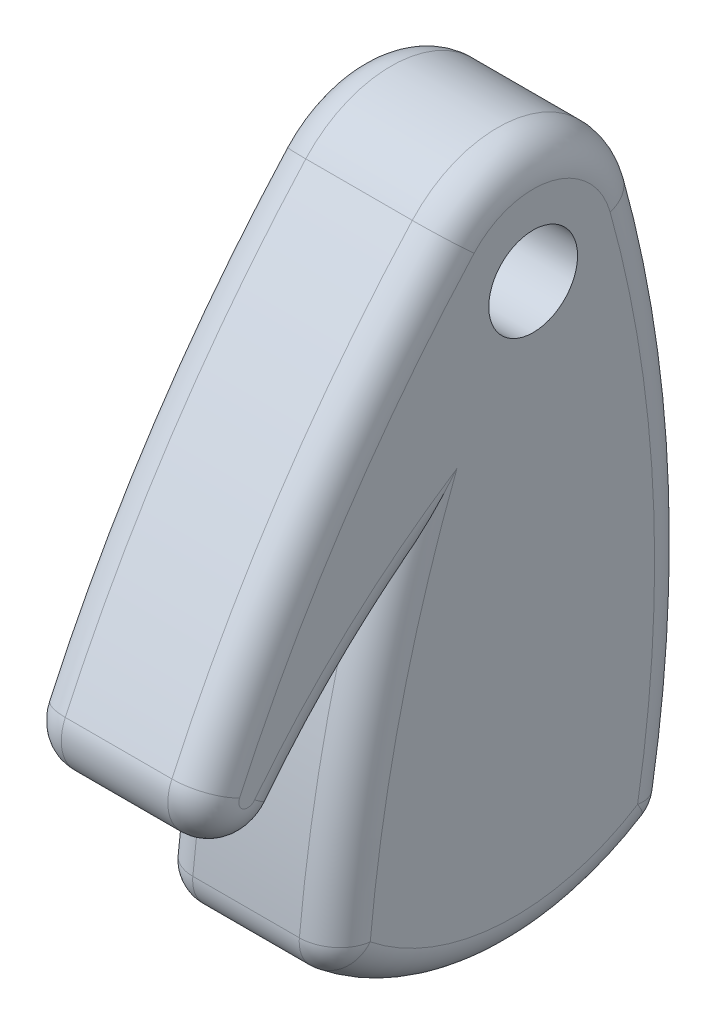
ISO-10303-21;
HEADER;
FILE_DESCRIPTION(('STEP AP214'),'2;1');
FILE_NAME('part.step','',(''),(''),'','','');
FILE_SCHEMA(('AUTOMOTIVE_DESIGN { 1 0 10303 214 1 1 1 1 }'));
ENDSEC;
DATA;
#1=APPLICATION_CONTEXT('core data for automotive mechanical design processes');
#2=APPLICATION_PROTOCOL_DEFINITION('international standard','automotive_design',2000,#1);
#3=PRODUCT_CONTEXT('',#1,'mechanical');
#4=PRODUCT('Part','Part','',(#3));
#5=PRODUCT_RELATED_PRODUCT_CATEGORY('part','',(#4));
#6=PRODUCT_DEFINITION_FORMATION('','',#4);
#7=PRODUCT_DEFINITION_CONTEXT('part definition',#1,'design');
#8=PRODUCT_DEFINITION('design','',#6,#7);
#9=PRODUCT_DEFINITION_SHAPE('','',#8);
#10=(LENGTH_UNIT() NAMED_UNIT(*) SI_UNIT(.MILLI.,.METRE.));
#11=(NAMED_UNIT(*) PLANE_ANGLE_UNIT() SI_UNIT($,.RADIAN.));
#12=(NAMED_UNIT(*) SI_UNIT($,.STERADIAN.) SOLID_ANGLE_UNIT());
#13=UNCERTAINTY_MEASURE_WITH_UNIT(LENGTH_MEASURE(1.E-05),#10,'distance_accuracy_value','');
#14=(GEOMETRIC_REPRESENTATION_CONTEXT(3) GLOBAL_UNCERTAINTY_ASSIGNED_CONTEXT((#13)) GLOBAL_UNIT_ASSIGNED_CONTEXT((#10,
#11,#12)) REPRESENTATION_CONTEXT('',''));
#15=CARTESIAN_POINT('',(0.,0.,0.));
#16=DIRECTION('',(0.,0.,1.));
#17=DIRECTION('',(1.,0.,0.));
#18=AXIS2_PLACEMENT_3D('',#15,#16,#17);
#19=CARTESIAN_POINT('',(279.4,-614.470114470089,-296.214944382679));
#20=DIRECTION('',(-1.,0.,0.));
#21=DIRECTION('',(0.,0.,1.));
#22=AXIS2_PLACEMENT_3D('',#19,#20,#21);
#23=CYLINDRICAL_SURFACE('',#22,406.4);
#24=DIRECTION('',(-1.,0.,0.));
#25=VECTOR('',#24,1.);
#26=CARTESIAN_POINT('',(279.4,-340.922578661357,4.33905351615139));
#27=LINE('',#26,#25);
#28=CARTESIAN_POINT('',(269.24,-340.922578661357,4.33905351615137));
#29=VERTEX_POINT('',#28);
#30=CARTESIAN_POINT('',(238.76,-340.922578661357,4.33905351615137));
#31=VERTEX_POINT('',#30);
#32=EDGE_CURVE('E144',#29,#31,#27,.T.);
#33=ORIENTED_EDGE('',*,*,#32,.T.);
#34=CARTESIAN_POINT('',(238.76,-614.470114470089,-296.214944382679));
#35=DIRECTION('',(1.,0.,0.));
#36=DIRECTION('',(0.,0.,-1.));
#37=AXIS2_PLACEMENT_3D('',#34,#35,#36);
#38=CIRCLE('',#37,406.4);
#39=CARTESIAN_POINT('',(238.76,-444.924083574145,73.129208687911));
#40=VERTEX_POINT('',#39);
#41=EDGE_CURVE('E151',#31,#40,#38,.T.);
#42=ORIENTED_EDGE('',*,*,#41,.T.);
#43=DIRECTION('',(-1.,0.,0.));
#44=VECTOR('',#43,1.);
#45=CARTESIAN_POINT('',(279.4,-444.924083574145,73.129208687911));
#46=LINE('',#45,#44);
#47=CARTESIAN_POINT('',(269.24,-444.924083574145,73.129208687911));
#48=VERTEX_POINT('',#47);
#49=EDGE_CURVE('E146',#48,#40,#46,.T.);
#50=ORIENTED_EDGE('',*,*,#49,.F.);
#51=CARTESIAN_POINT('',(269.24,-614.470114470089,-296.214944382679));
#52=DIRECTION('',(1.,0.,0.));
#53=DIRECTION('',(0.,0.,-1.));
#54=AXIS2_PLACEMENT_3D('',#51,#52,#53);
#55=CIRCLE('',#54,406.4);
#56=EDGE_CURVE('E142',#48,#29,#55,.F.);
#57=ORIENTED_EDGE('',*,*,#56,.T.);
#58=EDGE_LOOP('',(#33,#42,#50,#57));
#59=FACE_BOUND('',#58,.T.);
#60=ADVANCED_FACE('F31',(#59),#23,.T.);
#61=CARTESIAN_POINT('',(279.4,-450.222397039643,61.587203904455));
#62=DIRECTION('',(-1.,0.,0.));
#63=DIRECTION('',(0.,0.,1.));
#64=AXIS2_PLACEMENT_3D('',#61,#62,#63);
#65=CYLINDRICAL_SURFACE('',#64,12.7000000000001);
#66=ORIENTED_EDGE('',*,*,#49,.T.);
#67=CARTESIAN_POINT('',(238.76,-450.222397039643,61.587203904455));
#68=DIRECTION('',(1.,0.,0.));
#69=DIRECTION('',(0.,0.,-1.));
#70=AXIS2_PLACEMENT_3D('',#67,#68,#69);
#71=CIRCLE('',#70,12.7000000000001);
#72=CARTESIAN_POINT('',(238.76,-458.032291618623,51.572437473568));
#73=VERTEX_POINT('',#72);
#74=EDGE_CURVE('E206',#40,#73,#71,.T.);
#75=ORIENTED_EDGE('',*,*,#74,.T.);
#76=DIRECTION('',(-1.,0.,0.));
#77=VECTOR('',#76,1.);
#78=CARTESIAN_POINT('',(279.4,-458.032291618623,51.572437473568));
#79=LINE('',#78,#77);
#80=CARTESIAN_POINT('',(269.24,-458.032291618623,51.572437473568));
#81=VERTEX_POINT('',#80);
#82=EDGE_CURVE('E350',#81,#73,#79,.T.);
#83=ORIENTED_EDGE('',*,*,#82,.F.);
#84=CARTESIAN_POINT('',(269.24,-450.222397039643,61.587203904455));
#85=DIRECTION('',(1.,0.,0.));
#86=DIRECTION('',(0.,0.,-1.));
#87=AXIS2_PLACEMENT_3D('',#84,#85,#86);
#88=CIRCLE('',#87,12.7000000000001);
#89=EDGE_CURVE('E204',#81,#48,#88,.F.);
#90=ORIENTED_EDGE('',*,*,#89,.T.);
#91=EDGE_LOOP('',(#66,#75,#83,#90));
#92=FACE_BOUND('',#91,.T.);
#93=ADVANCED_FACE('F395',(#92),#65,.T.);
#94=CARTESIAN_POINT('',(279.4,-598.610394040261,-128.693358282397));
#95=DIRECTION('',(-1.,0.,0.));
#96=DIRECTION('',(0.,0.,1.));
#97=AXIS2_PLACEMENT_3D('',#94,#95,#96);
#98=CYLINDRICAL_SURFACE('',#97,228.6);
#99=ORIENTED_EDGE('',*,*,#82,.T.);
#100=CARTESIAN_POINT('',(238.76,-598.610394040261,-128.693358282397));
#101=DIRECTION('',(1.,0.,0.));
#102=DIRECTION('',(0.,0.,-1.));
#103=AXIS2_PLACEMENT_3D('',#100,#101,#102);
#104=CIRCLE('',#103,228.6);
#105=CARTESIAN_POINT('',(238.76,-426.690374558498,21.9767014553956));
#106=VERTEX_POINT('',#105);
#107=EDGE_CURVE('E210',#73,#106,#104,.F.);
#108=ORIENTED_EDGE('',*,*,#107,.T.);
#109=DIRECTION('',(-1.,0.,0.));
#110=VECTOR('',#109,1.);
#111=CARTESIAN_POINT('',(279.4,-426.690374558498,21.9767014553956));
#112=LINE('',#111,#110);
#113=CARTESIAN_POINT('',(269.24,-426.690374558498,21.9767014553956));
#114=VERTEX_POINT('',#113);
#115=EDGE_CURVE('E347',#114,#106,#112,.T.);
#116=ORIENTED_EDGE('',*,*,#115,.F.);
#117=CARTESIAN_POINT('',(269.24,-598.610394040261,-128.693358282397));
#118=DIRECTION('',(1.,0.,0.));
#119=DIRECTION('',(0.,0.,-1.));
#120=AXIS2_PLACEMENT_3D('',#117,#118,#119);
#121=CIRCLE('',#120,228.6);
#122=EDGE_CURVE('E208',#114,#81,#121,.T.);
#123=ORIENTED_EDGE('',*,*,#122,.T.);
#124=EDGE_LOOP('',(#99,#108,#116,#123));
#125=FACE_BOUND('',#124,.T.);
#126=ADVANCED_FACE('F399',(#125),#98,.F.);
#127=CARTESIAN_POINT('',(279.4,-541.431144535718,-367.889321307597));
#128=DIRECTION('',(-1.,0.,0.));
#129=DIRECTION('',(0.,0.,1.));
#130=AXIS2_PLACEMENT_3D('',#127,#128,#129);
#131=CYLINDRICAL_SURFACE('',#130,406.4);
#132=ORIENTED_EDGE('',*,*,#115,.T.);
#133=CARTESIAN_POINT('',(238.76,-541.431144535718,-367.889321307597));
#134=DIRECTION('',(1.,0.,0.));
#135=DIRECTION('',(0.,0.,-1.));
#136=AXIS2_PLACEMENT_3D('',#133,#134,#135);
#137=CIRCLE('',#136,406.4);
#138=CARTESIAN_POINT('',(238.76,-502.534245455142,36.6449680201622));
#139=VERTEX_POINT('',#138);
#140=EDGE_CURVE('E214',#106,#139,#137,.T.);
#141=ORIENTED_EDGE('',*,*,#140,.T.);
#142=DIRECTION('',(-1.,0.,0.));
#143=VECTOR('',#142,1.);
#144=CARTESIAN_POINT('',(279.4,-502.534245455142,36.6449680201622));
#145=LINE('',#144,#143);
#146=CARTESIAN_POINT('',(269.24,-502.534245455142,36.6449680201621));
#147=VERTEX_POINT('',#146);
#148=EDGE_CURVE('E181',#139,#147,#145,.F.);
#149=ORIENTED_EDGE('',*,*,#148,.T.);
#150=CARTESIAN_POINT('',(269.24,-541.431144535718,-367.889321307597));
#151=DIRECTION('',(1.,0.,0.));
#152=DIRECTION('',(0.,0.,-1.));
#153=AXIS2_PLACEMENT_3D('',#150,#151,#152);
#154=CIRCLE('',#153,406.4);
#155=EDGE_CURVE('E212',#147,#114,#154,.F.);
#156=ORIENTED_EDGE('',*,*,#155,.T.);
#157=EDGE_LOOP('',(#132,#141,#149,#156));
#158=FACE_BOUND('',#157,.T.);
#159=ADVANCED_FACE('F392',(#158),#131,.T.);
#160=CARTESIAN_POINT('',(279.4,-451.882494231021,-14.653657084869));
#161=DIRECTION('',(-1.,0.,0.));
#162=DIRECTION('',(0.,0.,1.));
#163=AXIS2_PLACEMENT_3D('',#160,#161,#162);
#164=CYLINDRICAL_SURFACE('',#163,76.2);
#165=DIRECTION('',(-1.,0.,0.));
#166=VECTOR('',#165,1.);
#167=CARTESIAN_POINT('',(279.4,-511.448848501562,32.8678058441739));
#168=LINE('',#167,#166);
#169=CARTESIAN_POINT('',(269.24,-511.448848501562,32.8678058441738));
#170=VERTEX_POINT('',#169);
#171=CARTESIAN_POINT('',(238.76,-511.448848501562,32.8678058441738));
#172=VERTEX_POINT('',#171);
#173=EDGE_CURVE('E357',#170,#172,#168,.T.);
#174=ORIENTED_EDGE('',*,*,#173,.T.);
#175=CARTESIAN_POINT('',(238.76,-451.882494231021,-14.653657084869));
#176=DIRECTION('',(1.,0.,0.));
#177=DIRECTION('',(0.,0.,-1.));
#178=AXIS2_PLACEMENT_3D('',#175,#176,#177);
#179=CIRCLE('',#178,76.2);
#180=CARTESIAN_POINT('',(238.76,-516.276266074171,-55.3953083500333));
#181=VERTEX_POINT('',#180);
#182=EDGE_CURVE('E223',#172,#181,#179,.T.);
#183=ORIENTED_EDGE('',*,*,#182,.T.);
#184=DIRECTION('',(-1.,0.,0.));
#185=VECTOR('',#184,1.);
#186=CARTESIAN_POINT('',(279.4,-516.276266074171,-55.3953083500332));
#187=LINE('',#186,#185);
#188=CARTESIAN_POINT('',(269.24,-516.276266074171,-55.3953083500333));
#189=VERTEX_POINT('',#188);
#190=EDGE_CURVE('E186',#181,#189,#187,.F.);
#191=ORIENTED_EDGE('',*,*,#190,.T.);
#192=CARTESIAN_POINT('',(269.24,-451.882494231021,-14.653657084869));
#193=DIRECTION('',(1.,0.,0.));
#194=DIRECTION('',(0.,0.,-1.));
#195=AXIS2_PLACEMENT_3D('',#192,#193,#194);
#196=CIRCLE('',#195,76.2);
#197=EDGE_CURVE('E221',#189,#170,#196,.F.);
#198=ORIENTED_EDGE('',*,*,#197,.T.);
#199=EDGE_LOOP('',(#174,#183,#191,#198));
#200=FACE_BOUND('',#199,.T.);
#201=ADVANCED_FACE('F362',(#200),#164,.T.);
#202=CARTESIAN_POINT('',(279.4,-449.914387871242,290.61101913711));
#203=DIRECTION('',(-1.,0.,0.));
#204=DIRECTION('',(0.,0.,1.));
#205=AXIS2_PLACEMENT_3D('',#202,#203,#204);
#206=CYLINDRICAL_SURFACE('',#205,355.6);
#207=DIRECTION('',(-1.,0.,0.));
#208=VECTOR('',#207,1.);
#209=CARTESIAN_POINT('',(279.4,-509.3897251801,-59.9799736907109));
#210=LINE('',#209,#208);
#211=CARTESIAN_POINT('',(269.24,-509.3897251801,-59.979973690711));
#212=VERTEX_POINT('',#211);
#213=CARTESIAN_POINT('',(238.76,-509.3897251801,-59.9799736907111));
#214=VERTEX_POINT('',#213);
#215=EDGE_CURVE('E354',#212,#214,#210,.T.);
#216=ORIENTED_EDGE('',*,*,#215,.T.);
#217=CARTESIAN_POINT('',(238.76,-449.914387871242,290.61101913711));
#218=DIRECTION('',(1.,0.,0.));
#219=DIRECTION('',(0.,0.,-1.));
#220=AXIS2_PLACEMENT_3D('',#217,#218,#219);
#221=CIRCLE('',#220,355.6);
#222=CARTESIAN_POINT('',(238.76,-354.266749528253,-51.8840746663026));
#223=VERTEX_POINT('',#222);
#224=EDGE_CURVE('E231',#214,#223,#221,.T.);
#225=ORIENTED_EDGE('',*,*,#224,.T.);
#226=DIRECTION('',(-1.,0.,0.));
#227=VECTOR('',#226,1.);
#228=CARTESIAN_POINT('',(279.4,-354.266749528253,-51.8840746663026));
#229=LINE('',#228,#227);
#230=CARTESIAN_POINT('',(269.24,-354.266749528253,-51.8840746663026));
#231=VERTEX_POINT('',#230);
#232=EDGE_CURVE('E163',#231,#223,#229,.T.);
#233=ORIENTED_EDGE('',*,*,#232,.F.);
#234=CARTESIAN_POINT('',(269.24,-449.914387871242,290.61101913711));
#235=DIRECTION('',(1.,0.,0.));
#236=DIRECTION('',(0.,0.,-1.));
#237=AXIS2_PLACEMENT_3D('',#234,#235,#236);
#238=CIRCLE('',#237,355.6);
#239=EDGE_CURVE('E229',#231,#212,#238,.F.);
#240=ORIENTED_EDGE('',*,*,#239,.T.);
#241=EDGE_LOOP('',(#216,#225,#233,#240));
#242=FACE_BOUND('',#241,.T.);
#243=ADVANCED_FACE('F384',(#242),#206,.T.);
#244=CARTESIAN_POINT('',(279.4,-363.148315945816,-20.0809588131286));
#245=DIRECTION('',(-1.,0.,0.));
#246=DIRECTION('',(0.,0.,1.));
#247=AXIS2_PLACEMENT_3D('',#244,#245,#246);
#248=CYLINDRICAL_SURFACE('',#247,33.02);
#249=ORIENTED_EDGE('',*,*,#232,.T.);
#250=CARTESIAN_POINT('',(238.76,-363.148315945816,-20.0809588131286));
#251=DIRECTION('',(1.,0.,0.));
#252=DIRECTION('',(0.,0.,-1.));
#253=AXIS2_PLACEMENT_3D('',#250,#251,#252);
#254=CIRCLE('',#253,33.02);
#255=EDGE_CURVE('E162',#223,#31,#254,.T.);
#256=ORIENTED_EDGE('',*,*,#255,.T.);
#257=ORIENTED_EDGE('',*,*,#32,.F.);
#258=CARTESIAN_POINT('',(269.24,-363.148315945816,-20.0809588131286));
#259=DIRECTION('',(1.,0.,0.));
#260=DIRECTION('',(0.,0.,-1.));
#261=AXIS2_PLACEMENT_3D('',#258,#259,#260);
#262=CIRCLE('',#261,33.02);
#263=EDGE_CURVE('E159',#29,#231,#262,.F.);
#264=ORIENTED_EDGE('',*,*,#263,.T.);
#265=EDGE_LOOP('',(#249,#256,#257,#264));
#266=FACE_BOUND('',#265,.T.);
#267=ADVANCED_FACE('F157',(#266),#248,.T.);
#268=CARTESIAN_POINT('',(279.4,-532.346255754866,-117.313870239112));
#269=DIRECTION('',(1.,0.,0.));
#270=DIRECTION('',(0.,0.,-1.));
#271=AXIS2_PLACEMENT_3D('',#268,#269,#270);
#272=PLANE('',#271);
#273=CARTESIAN_POINT('',(279.4,-363.148315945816,-20.0809588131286));
#274=DIRECTION('',(1.,0.,0.));
#275=DIRECTION('',(0.,1.,0.));
#276=AXIS2_PLACEMENT_3D('',#273,#274,#275);
#277=CIRCLE('',#276,12.7);
#278=CARTESIAN_POINT('',(279.4,-350.448315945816,-20.0809588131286));
#279=VERTEX_POINT('',#278);
#280=EDGE_CURVE('E435',#279,#279,#277,.T.);
#281=ORIENTED_EDGE('',*,*,#280,.F.);
#282=EDGE_LOOP('',(#281));
#283=FACE_BOUND('',#282,.T.);
#284=CARTESIAN_POINT('',(279.4,-598.610394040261,-128.693358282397));
#285=DIRECTION('',(1.,0.,0.));
#286=DIRECTION('',(0.,0.,-1.));
#287=AXIS2_PLACEMENT_3D('',#284,#285,#286);
#288=CIRCLE('',#287,238.76);
#289=CARTESIAN_POINT('',(279.4,-451.784375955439,59.5842506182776));
#290=VERTEX_POINT('',#289);
#291=CARTESIAN_POINT('',(279.4,-398.611600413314,1.71684127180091));
#292=VERTEX_POINT('',#291);
#293=EDGE_CURVE('E38',#290,#292,#288,.F.);
#294=ORIENTED_EDGE('',*,*,#293,.T.);
#295=CARTESIAN_POINT('',(279.4,-541.431144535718,-367.889321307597));
#296=DIRECTION('',(1.,0.,0.));
#297=DIRECTION('',(0.,0.,-1.));
#298=AXIS2_PLACEMENT_3D('',#295,#296,#297);
#299=CIRCLE('',#298,396.24);
#300=CARTESIAN_POINT('',(279.4,-503.506667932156,26.5316107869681));
#301=VERTEX_POINT('',#300);
#302=EDGE_CURVE('E11',#292,#301,#299,.T.);
#303=ORIENTED_EDGE('',*,*,#302,.T.);
#304=CARTESIAN_POINT('',(279.4,-451.882494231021,-14.653657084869));
#305=DIRECTION('',(1.,0.,0.));
#306=DIRECTION('',(0.,0.,-1.));
#307=AXIS2_PLACEMENT_3D('',#304,#305,#306);
#308=CIRCLE('',#307,66.04);
#309=CARTESIAN_POINT('',(279.4,-507.690429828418,-49.9630881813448));
#310=VERTEX_POINT('',#309);
#311=EDGE_CURVE('E233',#301,#310,#308,.T.);
#312=ORIENTED_EDGE('',*,*,#311,.T.);
#313=CARTESIAN_POINT('',(279.4,-449.914387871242,290.61101913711));
#314=DIRECTION('',(1.,0.,0.));
#315=DIRECTION('',(0.,0.,-1.));
#316=AXIS2_PLACEMENT_3D('',#313,#314,#315);
#317=CIRCLE('',#316,345.44);
#318=CARTESIAN_POINT('',(279.4,-356.999539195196,-42.0985005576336));
#319=VERTEX_POINT('',#318);
#320=EDGE_CURVE('E235',#310,#319,#317,.T.);
#321=ORIENTED_EDGE('',*,*,#320,.T.);
#322=CARTESIAN_POINT('',(279.4,-363.148315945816,-20.0809588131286));
#323=DIRECTION('',(1.,0.,0.));
#324=DIRECTION('',(0.,0.,-1.));
#325=AXIS2_PLACEMENT_3D('',#322,#323,#324);
#326=CIRCLE('',#325,22.86);
#327=CARTESIAN_POINT('',(279.4,-347.761267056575,-3.1747964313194));
#328=VERTEX_POINT('',#327);
#329=EDGE_CURVE('E237',#319,#328,#326,.T.);
#330=ORIENTED_EDGE('',*,*,#329,.T.);
#331=CARTESIAN_POINT('',(279.4,-614.470114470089,-296.214944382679));
#332=DIRECTION('',(1.,0.,0.));
#333=DIRECTION('',(0.,0.,-1.));
#334=AXIS2_PLACEMENT_3D('',#331,#332,#333);
#335=CIRCLE('',#334,396.24);
#336=CARTESIAN_POINT('',(279.4,-449.162734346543,63.8956048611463));
#337=VERTEX_POINT('',#336);
#338=EDGE_CURVE('E170',#328,#337,#335,.T.);
#339=ORIENTED_EDGE('',*,*,#338,.T.);
#340=CARTESIAN_POINT('',(279.4,-450.222397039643,61.587203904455));
#341=DIRECTION('',(1.,0.,0.));
#342=DIRECTION('',(0.,0.,-1.));
#343=AXIS2_PLACEMENT_3D('',#340,#341,#342);
#344=CIRCLE('',#343,2.5400000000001);
#345=EDGE_CURVE('E48',#337,#290,#344,.T.);
#346=ORIENTED_EDGE('',*,*,#345,.T.);
#347=EDGE_LOOP('',(#294,#303,#312,#321,#330,#339,#346));
#348=FACE_BOUND('',#347,.T.);
#349=ADVANCED_FACE('F240',(#283,#348),#272,.T.);
#350=CARTESIAN_POINT('',(228.6,-532.346255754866,-117.313870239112));
#351=DIRECTION('',(1.,0.,0.));
#352=DIRECTION('',(0.,0.,-1.));
#353=AXIS2_PLACEMENT_3D('',#350,#351,#352);
#354=PLANE('',#353);
#355=CARTESIAN_POINT('',(228.6,-363.148315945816,-20.0809588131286));
#356=DIRECTION('',(-1.,0.,0.));
#357=DIRECTION('',(0.,-1.,0.));
#358=AXIS2_PLACEMENT_3D('',#355,#356,#357);
#359=CIRCLE('',#358,12.7);
#360=CARTESIAN_POINT('',(228.6,-375.848315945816,-20.0809588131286));
#361=VERTEX_POINT('',#360);
#362=EDGE_CURVE('E437',#361,#361,#359,.T.);
#363=ORIENTED_EDGE('',*,*,#362,.F.);
#364=EDGE_LOOP('',(#363));
#365=FACE_BOUND('',#364,.T.);
#366=CARTESIAN_POINT('',(228.6,-614.470114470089,-296.214944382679));
#367=DIRECTION('',(1.,0.,0.));
#368=DIRECTION('',(0.,0.,-1.));
#369=AXIS2_PLACEMENT_3D('',#366,#367,#368);
#370=CIRCLE('',#369,396.24);
#371=CARTESIAN_POINT('',(228.6,-449.162734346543,63.8956048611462));
#372=VERTEX_POINT('',#371);
#373=CARTESIAN_POINT('',(228.6,-347.761267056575,-3.17479643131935));
#374=VERTEX_POINT('',#373);
#375=EDGE_CURVE('E199',#372,#374,#370,.F.);
#376=ORIENTED_EDGE('',*,*,#375,.T.);
#377=CARTESIAN_POINT('',(228.6,-363.148315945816,-20.0809588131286));
#378=DIRECTION('',(1.,0.,0.));
#379=DIRECTION('',(0.,0.,-1.));
#380=AXIS2_PLACEMENT_3D('',#377,#378,#379);
#381=CIRCLE('',#380,22.86);
#382=CARTESIAN_POINT('',(228.6,-356.999539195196,-42.0985005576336));
#383=VERTEX_POINT('',#382);
#384=EDGE_CURVE('E152',#374,#383,#381,.F.);
#385=ORIENTED_EDGE('',*,*,#384,.T.);
#386=CARTESIAN_POINT('',(228.6,-449.914387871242,290.61101913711));
#387=DIRECTION('',(1.,0.,0.));
#388=DIRECTION('',(0.,0.,-1.));
#389=AXIS2_PLACEMENT_3D('',#386,#387,#388);
#390=CIRCLE('',#389,345.44);
#391=CARTESIAN_POINT('',(228.6,-507.690429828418,-49.9630881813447));
#392=VERTEX_POINT('',#391);
#393=EDGE_CURVE('E183',#383,#392,#390,.F.);
#394=ORIENTED_EDGE('',*,*,#393,.T.);
#395=CARTESIAN_POINT('',(228.6,-451.882494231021,-14.653657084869));
#396=DIRECTION('',(1.,0.,0.));
#397=DIRECTION('',(0.,0.,-1.));
#398=AXIS2_PLACEMENT_3D('',#395,#396,#397);
#399=CIRCLE('',#398,66.04);
#400=CARTESIAN_POINT('',(228.6,-503.506667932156,26.5316107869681));
#401=VERTEX_POINT('',#400);
#402=EDGE_CURVE('E191',#392,#401,#399,.F.);
#403=ORIENTED_EDGE('',*,*,#402,.T.);
#404=CARTESIAN_POINT('',(228.6,-541.431144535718,-367.889321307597));
#405=DIRECTION('',(1.,0.,0.));
#406=DIRECTION('',(0.,0.,-1.));
#407=AXIS2_PLACEMENT_3D('',#404,#405,#406);
#408=CIRCLE('',#407,396.24);
#409=CARTESIAN_POINT('',(228.6,-398.611600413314,1.71684127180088));
#410=VERTEX_POINT('',#409);
#411=EDGE_CURVE('E193',#401,#410,#408,.F.);
#412=ORIENTED_EDGE('',*,*,#411,.T.);
#413=CARTESIAN_POINT('',(228.6,-598.610394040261,-128.693358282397));
#414=DIRECTION('',(1.,0.,0.));
#415=DIRECTION('',(0.,0.,-1.));
#416=AXIS2_PLACEMENT_3D('',#413,#414,#415);
#417=CIRCLE('',#416,238.76);
#418=CARTESIAN_POINT('',(228.6,-451.784375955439,59.5842506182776));
#419=VERTEX_POINT('',#418);
#420=EDGE_CURVE('E195',#410,#419,#417,.T.);
#421=ORIENTED_EDGE('',*,*,#420,.T.);
#422=CARTESIAN_POINT('',(228.6,-450.222397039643,61.587203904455));
#423=DIRECTION('',(1.,0.,0.));
#424=DIRECTION('',(0.,0.,-1.));
#425=AXIS2_PLACEMENT_3D('',#422,#423,#424);
#426=CIRCLE('',#425,2.5400000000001);
#427=EDGE_CURVE('E197',#419,#372,#426,.F.);
#428=ORIENTED_EDGE('',*,*,#427,.T.);
#429=EDGE_LOOP('',(#376,#385,#394,#403,#412,#421,#428));
#430=FACE_BOUND('',#429,.T.);
#431=ADVANCED_FACE('F424',(#365,#430),#354,.F.);
#432=CARTESIAN_POINT('',(279.4,-507.690429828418,-49.9630881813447));
#433=DIRECTION('',(-1.,0.,0.));
#434=DIRECTION('',(0.,0.,1.));
#435=AXIS2_PLACEMENT_3D('',#432,#433,#434);
#436=CYLINDRICAL_SURFACE('',#435,10.16);
#437=ORIENTED_EDGE('',*,*,#190,.F.);
#438=CARTESIAN_POINT('',(238.76,-507.690429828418,-49.9630881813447));
#439=DIRECTION('',(-1.,0.,0.));
#440=DIRECTION('',(0.,0.,1.));
#441=AXIS2_PLACEMENT_3D('',#438,#439,#440);
#442=CIRCLE('',#441,10.16);
#443=EDGE_CURVE('E227',#181,#214,#442,.F.);
#444=ORIENTED_EDGE('',*,*,#443,.T.);
#445=ORIENTED_EDGE('',*,*,#215,.F.);
#446=CARTESIAN_POINT('',(269.24,-507.690429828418,-49.9630881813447));
#447=DIRECTION('',(-1.,0.,0.));
#448=DIRECTION('',(0.,0.,1.));
#449=AXIS2_PLACEMENT_3D('',#446,#447,#448);
#450=CIRCLE('',#449,10.16);
#451=EDGE_CURVE('E225',#212,#189,#450,.T.);
#452=ORIENTED_EDGE('',*,*,#451,.T.);
#453=EDGE_LOOP('',(#437,#444,#445,#452));
#454=FACE_BOUND('',#453,.T.);
#455=ADVANCED_FACE('F367',(#454),#436,.T.);
#456=CARTESIAN_POINT('',(279.4,-503.506667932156,26.5316107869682));
#457=DIRECTION('',(-1.,0.,0.));
#458=DIRECTION('',(0.,0.,1.));
#459=AXIS2_PLACEMENT_3D('',#456,#457,#458);
#460=CYLINDRICAL_SURFACE('',#459,10.16);
#461=ORIENTED_EDGE('',*,*,#148,.F.);
#462=CARTESIAN_POINT('',(238.76,-503.506667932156,26.5316107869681));
#463=DIRECTION('',(-1.,0.,0.));
#464=DIRECTION('',(0.,0.,1.));
#465=AXIS2_PLACEMENT_3D('',#462,#463,#464);
#466=CIRCLE('',#465,10.16);
#467=EDGE_CURVE('E219',#139,#172,#466,.F.);
#468=ORIENTED_EDGE('',*,*,#467,.T.);
#469=ORIENTED_EDGE('',*,*,#173,.F.);
#470=CARTESIAN_POINT('',(269.24,-503.506667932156,26.5316107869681));
#471=DIRECTION('',(-1.,0.,0.));
#472=DIRECTION('',(0.,0.,1.));
#473=AXIS2_PLACEMENT_3D('',#470,#471,#472);
#474=CIRCLE('',#473,10.16);
#475=EDGE_CURVE('E216',#170,#147,#474,.T.);
#476=ORIENTED_EDGE('',*,*,#475,.T.);
#477=EDGE_LOOP('',(#461,#468,#469,#476));
#478=FACE_BOUND('',#477,.T.);
#479=ADVANCED_FACE('F431',(#478),#460,.T.);
#480=CARTESIAN_POINT('',(238.76,-503.506667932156,26.5316107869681));
#481=DIRECTION('',(0.,0.,1.));
#482=DIRECTION('',(1.,0.,0.));
#483=AXIS2_PLACEMENT_3D('',#480,#481,#482);
#484=SPHERICAL_SURFACE('',#483,10.16);
#485=CARTESIAN_POINT('',(238.76,-503.506667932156,26.5316107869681));
#486=DIRECTION('',(0.,-0.623641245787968,-0.781710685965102));
#487=DIRECTION('',(0.,0.781710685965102,-0.623641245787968));
#488=AXIS2_PLACEMENT_3D('',#485,#486,#487);
#489=CIRCLE('',#488,10.16);
#490=EDGE_CURVE('E339',#172,#401,#489,.T.);
#491=ORIENTED_EDGE('',*,*,#490,.F.);
#492=ORIENTED_EDGE('',*,*,#467,.F.);
#493=CARTESIAN_POINT('',(238.76,-503.506667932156,26.5316107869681));
#494=DIRECTION('',(0.,0.995409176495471,-0.0957108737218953));
#495=DIRECTION('',(0.,0.0957108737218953,0.995409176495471));
#496=AXIS2_PLACEMENT_3D('',#493,#494,#495);
#497=CIRCLE('',#496,10.16);
#498=EDGE_CURVE('E164',#401,#139,#497,.T.);
#499=ORIENTED_EDGE('',*,*,#498,.F.);
#500=EDGE_LOOP('',(#491,#492,#499));
#501=FACE_BOUND('',#500,.T.);
#502=ADVANCED_FACE('F429',(#501),#484,.T.);
#503=CARTESIAN_POINT('',(238.76,-541.431144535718,-367.889321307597));
#504=DIRECTION('',(1.,0.,0.));
#505=DIRECTION('',(0.,0.,-1.));
#506=AXIS2_PLACEMENT_3D('',#503,#504,#505);
#507=TOROIDAL_SURFACE('',#506,396.24,10.16);
#508=ORIENTED_EDGE('',*,*,#498,.T.);
#509=ORIENTED_EDGE('',*,*,#140,.F.);
#510=CARTESIAN_POINT('',(238.76,-426.690374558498,21.9767014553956));
#511=CARTESIAN_POINT('',(238.664123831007,-426.690425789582,21.9767336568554));
#512=CARTESIAN_POINT('',(238.568285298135,-426.686273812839,21.9740805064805));
#513=CARTESIAN_POINT('',(238.377733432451,-426.669965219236,21.9636562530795));
#514=CARTESIAN_POINT('',(238.283018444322,-426.657822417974,21.9558939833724));
#515=CARTESIAN_POINT('',(238.096863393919,-426.62617565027,21.9356588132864));
#516=CARTESIAN_POINT('',(238.0053953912,-426.606787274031,21.9232598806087));
#517=CARTESIAN_POINT('',(237.824843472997,-426.561275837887,21.894145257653));
#518=CARTESIAN_POINT('',(237.735760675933,-426.535149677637,21.877427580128));
#519=CARTESIAN_POINT('',(237.429480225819,-426.433308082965,21.8122335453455));
#520=CARTESIAN_POINT('',(237.219570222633,-426.341790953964,21.7536051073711));
#521=CARTESIAN_POINT('',(236.818806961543,-426.13186754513,21.6189120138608));
#522=CARTESIAN_POINT('',(236.628088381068,-426.013288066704,21.5427350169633));
#523=CARTESIAN_POINT('',(236.284641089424,-425.771699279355,21.3872573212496));
#524=CARTESIAN_POINT('',(236.130031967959,-425.650531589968,21.3091695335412));
#525=CARTESIAN_POINT('',(235.833600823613,-425.397650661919,21.145919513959));
#526=CARTESIAN_POINT('',(235.691789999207,-425.265928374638,21.0607512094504));
#527=CARTESIAN_POINT('',(235.419140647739,-424.994644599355,20.8850297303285));
#528=CARTESIAN_POINT('',(235.288315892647,-424.855073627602,20.7944700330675));
#529=CARTESIAN_POINT('',(235.036343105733,-424.570199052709,20.609284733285));
#530=CARTESIAN_POINT('',(234.915191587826,-424.424897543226,20.514660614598));
#531=CARTESIAN_POINT('',(234.617753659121,-424.049865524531,20.2699584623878));
#532=CARTESIAN_POINT('',(234.447188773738,-423.817072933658,20.117630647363));
#533=CARTESIAN_POINT('',(234.122100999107,-423.344156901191,19.8072207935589));
#534=CARTESIAN_POINT('',(233.967586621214,-423.104029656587,19.6491357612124));
#535=CARTESIAN_POINT('',(233.671738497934,-422.618140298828,19.3282476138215));
#536=CARTESIAN_POINT('',(233.530428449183,-422.372369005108,19.1654366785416));
#537=CARTESIAN_POINT('',(233.259252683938,-421.876955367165,18.8361995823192));
#538=CARTESIAN_POINT('',(233.129388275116,-421.627312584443,18.6697730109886));
#539=CARTESIAN_POINT('',(232.878886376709,-421.123764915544,18.3329928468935));
#540=CARTESIAN_POINT('',(232.758303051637,-420.869844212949,18.1626227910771));
#541=CARTESIAN_POINT('',(232.52591896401,-420.35976770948,17.8192619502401));
#542=CARTESIAN_POINT('',(232.414118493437,-420.103611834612,17.6462710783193));
#543=CARTESIAN_POINT('',(232.198449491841,-419.589876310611,17.2981851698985));
#544=CARTESIAN_POINT('',(232.094572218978,-419.332298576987,17.1230927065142));
#545=CARTESIAN_POINT('',(231.893831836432,-418.815826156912,16.7708532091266));
#546=CARTESIAN_POINT('',(231.796968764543,-418.556931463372,16.5937061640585));
#547=CARTESIAN_POINT('',(231.555738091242,-417.888964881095,16.1351402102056));
#548=CARTESIAN_POINT('',(231.416081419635,-417.479139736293,15.8523352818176));
#549=CARTESIAN_POINT('',(231.150582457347,-416.65785003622,15.2826208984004));
#550=CARTESIAN_POINT('',(231.024741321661,-416.246385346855,14.9957111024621));
#551=CARTESIAN_POINT('',(230.785367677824,-415.422334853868,14.4180927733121));
#552=CARTESIAN_POINT('',(230.671839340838,-415.009748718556,14.127382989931));
#553=CARTESIAN_POINT('',(230.455992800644,-414.184070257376,13.5425513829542));
#554=CARTESIAN_POINT('',(230.353674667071,-413.770977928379,13.2484295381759));
#555=CARTESIAN_POINT('',(230.159188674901,-412.943976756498,12.6565145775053));
#556=CARTESIAN_POINT('',(230.06703772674,-412.530067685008,12.358716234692));
#557=CARTESIAN_POINT('',(229.892367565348,-411.702395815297,11.7600995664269));
#558=CARTESIAN_POINT('',(229.809848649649,-411.288633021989,11.459281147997));
#559=CARTESIAN_POINT('',(229.575845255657,-410.047896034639,10.5524986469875));
#560=CARTESIAN_POINT('',(229.43791546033,-409.221478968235,9.94221142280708));
#561=CARTESIAN_POINT('',(229.255853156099,-407.985236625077,9.01971123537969));
#562=CARTESIAN_POINT('',(229.199359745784,-407.574232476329,8.71142354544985));
#563=CARTESIAN_POINT('',(229.094300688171,-406.753141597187,8.09234078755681));
#564=CARTESIAN_POINT('',(229.045734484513,-406.343054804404,7.78154589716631));
#565=CARTESIAN_POINT('',(228.911564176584,-405.114252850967,6.84544614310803));
#566=CARTESIAN_POINT('',(228.837496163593,-404.297049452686,6.21646599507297));
#567=CARTESIAN_POINT('',(228.71910032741,-402.6684677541,4.95004102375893));
#568=CARTESIAN_POINT('',(228.674741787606,-401.857084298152,4.31260564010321));
#569=CARTESIAN_POINT('',(228.615321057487,-400.240076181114,3.02923594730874));
#570=CARTESIAN_POINT('',(228.60025566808,-399.434450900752,2.38330257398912));
#571=CARTESIAN_POINT('',(228.600001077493,-398.625260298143,1.72790639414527));
#572=CARTESIAN_POINT('',(228.600000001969,-398.618430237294,1.72237397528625));
#573=CARTESIAN_POINT('',(228.6,-398.611600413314,1.71684127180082));
#574=B_SPLINE_CURVE_WITH_KNOTS('',3,(#510,#511,#512,#513,#514,#515,#516,#517,#518,#519,#520,
#521,#522,#523,#524,#525,#526,#527,#528,#529,#530,#531,#532,#533,#534,#535,#536,#537,#538,#539,
#540,#541,#542,#543,#544,#545,#546,#547,#548,#549,#550,#551,#552,#553,#554,#555,#556,#557,#558,
#559,#560,#561,#562,#563,#564,#565,#566,#567,#568,#569,#570,#571,#572,#573),.UNSPECIFIED.,.F.,
.F.,(4,2,2,2,2,2,2,2,2,2,2,2,2,2,2,2,2,2,2,2,2,2,2,2,2,2,2,2,2,2,2,4),(0.,0.287441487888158,
0.574387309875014,0.856938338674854,1.13961961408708,1.84433011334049,2.55368392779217,
3.18689894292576,3.82066275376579,4.45520953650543,5.08952659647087,6.06776570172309,
7.04652093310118,8.0270002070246,9.00759135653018,9.9935286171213,10.979498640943,
11.9643645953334,12.9492358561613,14.500418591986,16.0517309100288,17.6035671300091,
19.155412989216,20.7098022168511,22.2642394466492,25.3731354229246,26.9237034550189,
28.4741626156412,31.5752818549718,34.6731898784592,37.7707595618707,37.7971284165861),.UNSPECIFIED.);
#575=EDGE_CURVE('E332',#410,#106,#574,.F.);
#576=ORIENTED_EDGE('',*,*,#575,.F.);
#577=ORIENTED_EDGE('',*,*,#411,.F.);
#578=EDGE_LOOP('',(#508,#509,#576,#577));
#579=FACE_BOUND('',#578,.T.);
#580=ADVANCED_FACE('F328',(#579),#507,.T.);
#581=CARTESIAN_POINT('',(238.76,-451.882494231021,-14.653657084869));
#582=DIRECTION('',(1.,0.,0.));
#583=DIRECTION('',(0.,0.,-1.));
#584=AXIS2_PLACEMENT_3D('',#581,#582,#583);
#585=TOROIDAL_SURFACE('',#584,66.04,10.16);
#586=ORIENTED_EDGE('',*,*,#490,.T.);
#587=ORIENTED_EDGE('',*,*,#402,.F.);
#588=CARTESIAN_POINT('',(238.76,-507.690429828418,-49.9630881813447));
#589=DIRECTION('',(0.,0.534667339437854,-0.845062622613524));
#590=DIRECTION('',(0.,0.845062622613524,0.534667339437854));
#591=AXIS2_PLACEMENT_3D('',#588,#589,#590);
#592=CIRCLE('',#591,10.16);
#593=EDGE_CURVE('E340',#181,#392,#592,.T.);
#594=ORIENTED_EDGE('',*,*,#593,.F.);
#595=ORIENTED_EDGE('',*,*,#182,.F.);
#596=EDGE_LOOP('',(#586,#587,#594,#595));
#597=FACE_BOUND('',#596,.T.);
#598=ADVANCED_FACE('F326',(#597),#585,.T.);
#599=CARTESIAN_POINT('',(238.76,-598.610394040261,-128.693358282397));
#600=DIRECTION('',(1.,0.,0.));
#601=DIRECTION('',(0.,0.,-1.));
#602=AXIS2_PLACEMENT_3D('',#599,#600,#601);
#603=TOROIDAL_SURFACE('',#602,238.76,10.16);
#604=ORIENTED_EDGE('',*,*,#575,.T.);
#605=ORIENTED_EDGE('',*,*,#107,.F.);
#606=CARTESIAN_POINT('',(238.76,-451.784375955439,59.5842506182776));
#607=DIRECTION('',(0.,-0.788564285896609,0.614952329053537));
#608=DIRECTION('',(0.,-0.614952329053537,-0.788564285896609));
#609=AXIS2_PLACEMENT_3D('',#606,#607,#608);
#610=CIRCLE('',#609,10.16);
#611=EDGE_CURVE('E375',#419,#73,#610,.T.);
#612=ORIENTED_EDGE('',*,*,#611,.F.);
#613=ORIENTED_EDGE('',*,*,#420,.F.);
#614=EDGE_LOOP('',(#604,#605,#612,#613));
#615=FACE_BOUND('',#614,.T.);
#616=ADVANCED_FACE('F321',(#615),#603,.T.);
#617=CARTESIAN_POINT('',(238.76,-507.690429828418,-49.9630881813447));
#618=DIRECTION('',(0.,0.,1.));
#619=DIRECTION('',(1.,0.,0.));
#620=AXIS2_PLACEMENT_3D('',#617,#618,#619);
#621=SPHERICAL_SURFACE('',#620,10.16);
#622=ORIENTED_EDGE('',*,*,#443,.F.);
#623=ORIENTED_EDGE('',*,*,#593,.T.);
#624=CARTESIAN_POINT('',(238.76,-507.690429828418,-49.9630881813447));
#625=DIRECTION('',(0.,0.985913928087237,-0.167253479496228));
#626=DIRECTION('',(0.,0.167253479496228,0.985913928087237));
#627=AXIS2_PLACEMENT_3D('',#624,#625,#626);
#628=CIRCLE('',#627,10.16);
#629=EDGE_CURVE('E376',#214,#392,#628,.T.);
#630=ORIENTED_EDGE('',*,*,#629,.F.);
#631=EDGE_LOOP('',(#622,#623,#630));
#632=FACE_BOUND('',#631,.T.);
#633=ADVANCED_FACE('F317',(#632),#621,.T.);
#634=CARTESIAN_POINT('',(238.76,-450.222397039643,61.587203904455));
#635=DIRECTION('',(1.,0.,0.));
#636=DIRECTION('',(0.,0.,-1.));
#637=AXIS2_PLACEMENT_3D('',#634,#635,#636);
#638=DEGENERATE_TOROIDAL_SURFACE('',#637,2.5400000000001,10.16,.T.);
#639=ORIENTED_EDGE('',*,*,#611,.T.);
#640=ORIENTED_EDGE('',*,*,#74,.F.);
#641=CARTESIAN_POINT('',(238.76,-449.162734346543,63.8956048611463));
#642=DIRECTION('',(0.,0.908819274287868,-0.41719003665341));
#643=DIRECTION('',(0.,0.41719003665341,0.908819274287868));
#644=AXIS2_PLACEMENT_3D('',#641,#642,#643);
#645=CIRCLE('',#644,10.16);
#646=EDGE_CURVE('E379',#372,#40,#645,.T.);
#647=ORIENTED_EDGE('',*,*,#646,.F.);
#648=ORIENTED_EDGE('',*,*,#427,.F.);
#649=EDGE_LOOP('',(#639,#640,#647,#648));
#650=FACE_BOUND('',#649,.T.);
#651=ADVANCED_FACE('F313',(#650),#638,.T.);
#652=CARTESIAN_POINT('',(238.76,-449.914387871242,290.61101913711));
#653=DIRECTION('',(1.,0.,0.));
#654=DIRECTION('',(0.,0.,-1.));
#655=AXIS2_PLACEMENT_3D('',#652,#653,#654);
#656=TOROIDAL_SURFACE('',#655,345.44,10.16);
#657=ORIENTED_EDGE('',*,*,#629,.T.);
#658=ORIENTED_EDGE('',*,*,#393,.F.);
#659=CARTESIAN_POINT('',(238.76,-356.999539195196,-42.0985005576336));
#660=DIRECTION('',(0.,0.963147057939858,0.268975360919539));
#661=DIRECTION('',(0.,-0.268975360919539,0.963147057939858));
#662=AXIS2_PLACEMENT_3D('',#659,#660,#661);
#663=CIRCLE('',#662,10.16);
#664=EDGE_CURVE('E382',#223,#383,#663,.T.);
#665=ORIENTED_EDGE('',*,*,#664,.F.);
#666=ORIENTED_EDGE('',*,*,#224,.F.);
#667=EDGE_LOOP('',(#657,#658,#665,#666));
#668=FACE_BOUND('',#667,.T.);
#669=ADVANCED_FACE('F309',(#668),#656,.T.);
#670=CARTESIAN_POINT('',(238.76,-614.470114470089,-296.214944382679));
#671=DIRECTION('',(1.,0.,0.));
#672=DIRECTION('',(0.,0.,-1.));
#673=AXIS2_PLACEMENT_3D('',#670,#671,#672);
#674=TOROIDAL_SURFACE('',#673,396.24,10.16);
#675=ORIENTED_EDGE('',*,*,#646,.T.);
#676=ORIENTED_EDGE('',*,*,#41,.F.);
#677=CARTESIAN_POINT('',(238.76,-347.761267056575,-3.17479643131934));
#678=DIRECTION('',(0.,0.739552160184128,-0.673099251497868));
#679=DIRECTION('',(0.,0.673099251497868,0.739552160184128));
#680=AXIS2_PLACEMENT_3D('',#677,#678,#679);
#681=CIRCLE('',#680,10.16);
#682=EDGE_CURVE('E173',#374,#31,#681,.T.);
#683=ORIENTED_EDGE('',*,*,#682,.F.);
#684=ORIENTED_EDGE('',*,*,#375,.F.);
#685=EDGE_LOOP('',(#675,#676,#683,#684));
#686=FACE_BOUND('',#685,.T.);
#687=ADVANCED_FACE('F305',(#686),#674,.T.);
#688=CARTESIAN_POINT('',(238.76,-363.148315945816,-20.0809588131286));
#689=DIRECTION('',(1.,0.,0.));
#690=DIRECTION('',(0.,0.,-1.));
#691=AXIS2_PLACEMENT_3D('',#688,#689,#690);
#692=TOROIDAL_SURFACE('',#691,22.86,10.16);
#693=ORIENTED_EDGE('',*,*,#664,.T.);
#694=ORIENTED_EDGE('',*,*,#384,.F.);
#695=ORIENTED_EDGE('',*,*,#682,.T.);
#696=ORIENTED_EDGE('',*,*,#255,.F.);
#697=EDGE_LOOP('',(#693,#694,#695,#696));
#698=FACE_BOUND('',#697,.T.);
#699=ADVANCED_FACE('F302',(#698),#692,.T.);
#700=CARTESIAN_POINT('',(269.24,-614.470114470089,-296.214944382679));
#701=DIRECTION('',(1.,0.,0.));
#702=DIRECTION('',(0.,0.,-1.));
#703=AXIS2_PLACEMENT_3D('',#700,#701,#702);
#704=TOROIDAL_SURFACE('',#703,396.24,10.16);
#705=CARTESIAN_POINT('',(269.24,-449.162734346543,63.8956048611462));
#706=DIRECTION('',(0.,-0.908819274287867,0.417190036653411));
#707=DIRECTION('',(0.,-0.417190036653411,-0.908819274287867));
#708=AXIS2_PLACEMENT_3D('',#705,#706,#707);
#709=CIRCLE('',#708,10.16);
#710=EDGE_CURVE('E174',#337,#48,#709,.T.);
#711=ORIENTED_EDGE('',*,*,#710,.F.);
#712=ORIENTED_EDGE('',*,*,#338,.F.);
#713=CARTESIAN_POINT('',(269.24,-347.761267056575,-3.17479643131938));
#714=DIRECTION('',(0.,0.739552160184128,-0.673099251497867));
#715=DIRECTION('',(0.,0.673099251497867,0.739552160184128));
#716=AXIS2_PLACEMENT_3D('',#713,#714,#715);
#717=CIRCLE('',#716,10.16);
#718=EDGE_CURVE('E168',#29,#328,#717,.T.);
#719=ORIENTED_EDGE('',*,*,#718,.F.);
#720=ORIENTED_EDGE('',*,*,#56,.F.);
#721=EDGE_LOOP('',(#711,#712,#719,#720));
#722=FACE_BOUND('',#721,.T.);
#723=ADVANCED_FACE('F169',(#722),#704,.T.);
#724=CARTESIAN_POINT('',(269.24,-363.148315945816,-20.0809588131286));
#725=DIRECTION('',(1.,0.,0.));
#726=DIRECTION('',(0.,0.,-1.));
#727=AXIS2_PLACEMENT_3D('',#724,#725,#726);
#728=TOROIDAL_SURFACE('',#727,22.86,10.16);
#729=ORIENTED_EDGE('',*,*,#718,.T.);
#730=ORIENTED_EDGE('',*,*,#329,.F.);
#731=CARTESIAN_POINT('',(269.24,-356.999539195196,-42.0985005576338));
#732=DIRECTION('',(0.,-0.963147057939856,-0.268975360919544));
#733=DIRECTION('',(0.,0.268975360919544,-0.963147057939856));
#734=AXIS2_PLACEMENT_3D('',#731,#732,#733);
#735=CIRCLE('',#734,10.16);
#736=EDGE_CURVE('E179',#231,#319,#735,.T.);
#737=ORIENTED_EDGE('',*,*,#736,.F.);
#738=ORIENTED_EDGE('',*,*,#263,.F.);
#739=EDGE_LOOP('',(#729,#730,#737,#738));
#740=FACE_BOUND('',#739,.T.);
#741=ADVANCED_FACE('F177',(#740),#728,.T.);
#742=CARTESIAN_POINT('',(269.24,-450.222397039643,61.587203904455));
#743=DIRECTION('',(1.,0.,0.));
#744=DIRECTION('',(0.,0.,-1.));
#745=AXIS2_PLACEMENT_3D('',#742,#743,#744);
#746=DEGENERATE_TOROIDAL_SURFACE('',#745,2.5400000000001,10.16,.T.);
#747=ORIENTED_EDGE('',*,*,#710,.T.);
#748=ORIENTED_EDGE('',*,*,#89,.F.);
#749=CARTESIAN_POINT('',(269.24,-451.784375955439,59.5842506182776));
#750=DIRECTION('',(0.,0.788564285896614,-0.614952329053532));
#751=DIRECTION('',(0.,0.614952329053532,0.788564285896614));
#752=AXIS2_PLACEMENT_3D('',#749,#750,#751);
#753=CIRCLE('',#752,10.16);
#754=EDGE_CURVE('E246',#290,#81,#753,.T.);
#755=ORIENTED_EDGE('',*,*,#754,.F.);
#756=ORIENTED_EDGE('',*,*,#345,.F.);
#757=EDGE_LOOP('',(#747,#748,#755,#756));
#758=FACE_BOUND('',#757,.T.);
#759=ADVANCED_FACE('F244',(#758),#746,.T.);
#760=CARTESIAN_POINT('',(269.24,-449.914387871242,290.61101913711));
#761=DIRECTION('',(1.,0.,0.));
#762=DIRECTION('',(0.,0.,-1.));
#763=AXIS2_PLACEMENT_3D('',#760,#761,#762);
#764=TOROIDAL_SURFACE('',#763,345.44,10.16);
#765=ORIENTED_EDGE('',*,*,#736,.T.);
#766=ORIENTED_EDGE('',*,*,#320,.F.);
#767=CARTESIAN_POINT('',(269.24,-507.690429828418,-49.9630881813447));
#768=DIRECTION('',(0.,-0.985913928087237,0.167253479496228));
#769=DIRECTION('',(0.,-0.167253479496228,-0.985913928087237));
#770=AXIS2_PLACEMENT_3D('',#767,#768,#769);
#771=CIRCLE('',#770,10.16);
#772=EDGE_CURVE('E249',#212,#310,#771,.T.);
#773=ORIENTED_EDGE('',*,*,#772,.F.);
#774=ORIENTED_EDGE('',*,*,#239,.F.);
#775=EDGE_LOOP('',(#765,#766,#773,#774));
#776=FACE_BOUND('',#775,.T.);
#777=ADVANCED_FACE('F270',(#776),#764,.T.);
#778=CARTESIAN_POINT('',(269.24,-598.610394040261,-128.693358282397));
#779=DIRECTION('',(1.,0.,0.));
#780=DIRECTION('',(0.,0.,-1.));
#781=AXIS2_PLACEMENT_3D('',#778,#779,#780);
#782=TOROIDAL_SURFACE('',#781,238.76,10.16);
#783=ORIENTED_EDGE('',*,*,#754,.T.);
#784=ORIENTED_EDGE('',*,*,#122,.F.);
#785=CARTESIAN_POINT('',(269.24,-426.690374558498,21.9767014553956));
#786=CARTESIAN_POINT('',(269.335876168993,-426.690425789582,21.9767336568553));
#787=CARTESIAN_POINT('',(269.431714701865,-426.686273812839,21.9740805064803));
#788=CARTESIAN_POINT('',(269.622266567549,-426.669965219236,21.9636562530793));
#789=CARTESIAN_POINT('',(269.716981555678,-426.657822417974,21.9558939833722));
#790=CARTESIAN_POINT('',(269.903136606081,-426.62617565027,21.9356588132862));
#791=CARTESIAN_POINT('',(269.9946046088,-426.606787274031,21.9232598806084));
#792=CARTESIAN_POINT('',(270.175156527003,-426.561275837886,21.8941452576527));
#793=CARTESIAN_POINT('',(270.264239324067,-426.535149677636,21.877427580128));
#794=CARTESIAN_POINT('',(270.570519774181,-426.433308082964,21.8122335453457));
#795=CARTESIAN_POINT('',(270.780429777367,-426.341790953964,21.753605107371));
#796=CARTESIAN_POINT('',(271.181193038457,-426.13186754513,21.6189120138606));
#797=CARTESIAN_POINT('',(271.371911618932,-426.013288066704,21.5427350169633));
#798=CARTESIAN_POINT('',(271.715358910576,-425.771699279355,21.3872573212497));
#799=CARTESIAN_POINT('',(271.869968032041,-425.650531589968,21.3091695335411));
#800=CARTESIAN_POINT('',(272.166399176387,-425.397650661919,21.1459195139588));
#801=CARTESIAN_POINT('',(272.308210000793,-425.265928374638,21.0607512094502));
#802=CARTESIAN_POINT('',(272.580859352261,-424.994644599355,20.8850297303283));
#803=CARTESIAN_POINT('',(272.711684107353,-424.855073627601,20.7944700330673));
#804=CARTESIAN_POINT('',(272.963656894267,-424.570199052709,20.6092847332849));
#805=CARTESIAN_POINT('',(273.084808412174,-424.424897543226,20.514660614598));
#806=CARTESIAN_POINT('',(273.382246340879,-424.049865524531,20.2699584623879));
#807=CARTESIAN_POINT('',(273.552811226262,-423.817072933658,20.1176306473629));
#808=CARTESIAN_POINT('',(273.877899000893,-423.344156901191,19.8072207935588));
#809=CARTESIAN_POINT('',(274.032413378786,-423.104029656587,19.6491357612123));
#810=CARTESIAN_POINT('',(274.328261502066,-422.618140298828,19.3282476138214));
#811=CARTESIAN_POINT('',(274.469571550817,-422.372369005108,19.1654366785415));
#812=CARTESIAN_POINT('',(274.740747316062,-421.876955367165,18.8361995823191));
#813=CARTESIAN_POINT('',(274.870611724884,-421.627312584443,18.6697730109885));
#814=CARTESIAN_POINT('',(275.121113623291,-421.123764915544,18.3329928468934));
#815=CARTESIAN_POINT('',(275.241696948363,-420.869844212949,18.162622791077));
#816=CARTESIAN_POINT('',(275.47408103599,-420.35976770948,17.8192619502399));
#817=CARTESIAN_POINT('',(275.585881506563,-420.103611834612,17.6462710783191));
#818=CARTESIAN_POINT('',(275.801550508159,-419.589876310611,17.2981851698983));
#819=CARTESIAN_POINT('',(275.905427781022,-419.332298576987,17.1230927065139));
#820=CARTESIAN_POINT('',(276.106168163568,-418.815826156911,16.7708532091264));
#821=CARTESIAN_POINT('',(276.203031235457,-418.556931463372,16.5937061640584));
#822=CARTESIAN_POINT('',(276.444261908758,-417.888964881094,16.1351402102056));
#823=CARTESIAN_POINT('',(276.583918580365,-417.479139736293,15.8523352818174));
#824=CARTESIAN_POINT('',(276.849417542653,-416.65785003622,15.2826208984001));
#825=CARTESIAN_POINT('',(276.975258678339,-416.246385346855,14.9957111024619));
#826=CARTESIAN_POINT('',(277.214632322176,-415.422334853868,14.4180927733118));
#827=CARTESIAN_POINT('',(277.328160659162,-415.009748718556,14.1273829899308));
#828=CARTESIAN_POINT('',(277.544007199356,-414.184070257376,13.542551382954));
#829=CARTESIAN_POINT('',(277.646325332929,-413.770977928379,13.2484295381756));
#830=CARTESIAN_POINT('',(277.840811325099,-412.943976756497,12.656514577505));
#831=CARTESIAN_POINT('',(277.93296227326,-412.530067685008,12.3587162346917));
#832=CARTESIAN_POINT('',(278.107632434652,-411.702395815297,11.7600995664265));
#833=CARTESIAN_POINT('',(278.190151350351,-411.288633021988,11.4592811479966));
#834=CARTESIAN_POINT('',(278.424154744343,-410.047896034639,10.552498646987));
#835=CARTESIAN_POINT('',(278.562084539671,-409.221478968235,9.9422114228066));
#836=CARTESIAN_POINT('',(278.744146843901,-407.985236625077,9.01971123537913));
#837=CARTESIAN_POINT('',(278.800640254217,-407.574232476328,8.71142354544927));
#838=CARTESIAN_POINT('',(278.905699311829,-406.753141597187,8.09234078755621));
#839=CARTESIAN_POINT('',(278.954265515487,-406.343054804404,7.78154589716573));
#840=CARTESIAN_POINT('',(279.088435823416,-405.114252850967,6.84544614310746));
#841=CARTESIAN_POINT('',(279.162503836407,-404.297049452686,6.21646599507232));
#842=CARTESIAN_POINT('',(279.28089967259,-402.6684677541,4.95004102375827));
#843=CARTESIAN_POINT('',(279.325258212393,-401.857084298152,4.31260564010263));
#844=CARTESIAN_POINT('',(279.384678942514,-400.240076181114,3.02923594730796));
#845=CARTESIAN_POINT('',(279.399744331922,-399.434450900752,2.38330257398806));
#846=CARTESIAN_POINT('',(279.399998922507,-398.625260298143,1.72790639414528));
#847=CARTESIAN_POINT('',(279.399999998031,-398.618430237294,1.72237397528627));
#848=CARTESIAN_POINT('',(279.4,-398.611600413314,1.71684127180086));
#849=B_SPLINE_CURVE_WITH_KNOTS('',3,(#785,#786,#787,#788,#789,#790,#791,#792,#793,#794,#795,
#796,#797,#798,#799,#800,#801,#802,#803,#804,#805,#806,#807,#808,#809,#810,#811,#812,#813,#814,
#815,#816,#817,#818,#819,#820,#821,#822,#823,#824,#825,#826,#827,#828,#829,#830,#831,#832,#833,
#834,#835,#836,#837,#838,#839,#840,#841,#842,#843,#844,#845,#846,#847,#848),.UNSPECIFIED.,.F.,
.F.,(4,2,2,2,2,2,2,2,2,2,2,2,2,2,2,2,2,2,2,2,2,2,2,2,2,2,2,2,2,2,2,4),(0.,0.287441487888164,
0.574387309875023,0.856938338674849,1.13961961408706,1.84433011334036,2.55368392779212,
3.18689894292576,3.82066275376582,4.45520953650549,5.08952659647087,6.06776570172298,
7.04652093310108,8.02700020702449,9.00759135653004,9.99352861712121,10.9794986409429,
11.9643645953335,12.9492358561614,14.5004185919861,16.0517309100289,17.6035671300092,
19.1554129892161,20.7098022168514,22.2642394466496,25.3731354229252,26.9237034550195,
28.4741626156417,31.5752818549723,34.6731898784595,37.7707595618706,37.797128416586),.UNSPECIFIED.);
#850=EDGE_CURVE('E253',#292,#114,#849,.F.);
#851=ORIENTED_EDGE('',*,*,#850,.F.);
#852=ORIENTED_EDGE('',*,*,#293,.F.);
#853=EDGE_LOOP('',(#783,#784,#851,#852));
#854=FACE_BOUND('',#853,.T.);
#855=ADVANCED_FACE('F251',(#854),#782,.T.);
#856=CARTESIAN_POINT('',(269.24,-507.690429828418,-49.9630881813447));
#857=DIRECTION('',(0.,0.,1.));
#858=DIRECTION('',(1.,0.,0.));
#859=AXIS2_PLACEMENT_3D('',#856,#857,#858);
#860=SPHERICAL_SURFACE('',#859,10.16);
#861=ORIENTED_EDGE('',*,*,#451,.F.);
#862=ORIENTED_EDGE('',*,*,#772,.T.);
#863=CARTESIAN_POINT('',(269.24,-507.690429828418,-49.9630881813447));
#864=DIRECTION('',(0.,-0.534667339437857,0.845062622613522));
#865=DIRECTION('',(0.,-0.845062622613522,-0.534667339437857));
#866=AXIS2_PLACEMENT_3D('',#863,#864,#865);
#867=CIRCLE('',#866,10.16);
#868=EDGE_CURVE('E257',#189,#310,#867,.T.);
#869=ORIENTED_EDGE('',*,*,#868,.F.);
#870=EDGE_LOOP('',(#861,#862,#869));
#871=FACE_BOUND('',#870,.T.);
#872=ADVANCED_FACE('F274',(#871),#860,.T.);
#873=CARTESIAN_POINT('',(269.24,-541.431144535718,-367.889321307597));
#874=DIRECTION('',(1.,0.,0.));
#875=DIRECTION('',(0.,0.,-1.));
#876=AXIS2_PLACEMENT_3D('',#873,#874,#875);
#877=TOROIDAL_SURFACE('',#876,396.24,10.16);
#878=ORIENTED_EDGE('',*,*,#850,.T.);
#879=ORIENTED_EDGE('',*,*,#155,.F.);
#880=CARTESIAN_POINT('',(269.24,-503.506667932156,26.5316107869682));
#881=DIRECTION('',(0.,-0.995409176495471,0.0957108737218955));
#882=DIRECTION('',(0.,-0.0957108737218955,-0.995409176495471));
#883=AXIS2_PLACEMENT_3D('',#880,#881,#882);
#884=CIRCLE('',#883,10.16);
#885=EDGE_CURVE('E261',#301,#147,#884,.T.);
#886=ORIENTED_EDGE('',*,*,#885,.F.);
#887=ORIENTED_EDGE('',*,*,#302,.F.);
#888=EDGE_LOOP('',(#878,#879,#886,#887));
#889=FACE_BOUND('',#888,.T.);
#890=ADVANCED_FACE('F260',(#889),#877,.T.);
#891=CARTESIAN_POINT('',(269.24,-451.882494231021,-14.653657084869));
#892=DIRECTION('',(1.,0.,0.));
#893=DIRECTION('',(0.,0.,-1.));
#894=AXIS2_PLACEMENT_3D('',#891,#892,#893);
#895=TOROIDAL_SURFACE('',#894,66.04,10.16);
#896=ORIENTED_EDGE('',*,*,#868,.T.);
#897=ORIENTED_EDGE('',*,*,#311,.F.);
#898=CARTESIAN_POINT('',(269.24,-503.506667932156,26.5316107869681));
#899=DIRECTION('',(0.,0.623641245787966,0.781710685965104));
#900=DIRECTION('',(0.,-0.781710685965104,0.623641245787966));
#901=AXIS2_PLACEMENT_3D('',#898,#899,#900);
#902=CIRCLE('',#901,10.16);
#903=EDGE_CURVE('E279',#170,#301,#902,.T.);
#904=ORIENTED_EDGE('',*,*,#903,.F.);
#905=ORIENTED_EDGE('',*,*,#197,.F.);
#906=EDGE_LOOP('',(#896,#897,#904,#905));
#907=FACE_BOUND('',#906,.T.);
#908=ADVANCED_FACE('F277',(#907),#895,.T.);
#909=CARTESIAN_POINT('',(269.24,-503.506667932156,26.5316107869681));
#910=DIRECTION('',(0.,0.,1.));
#911=DIRECTION('',(1.,0.,0.));
#912=AXIS2_PLACEMENT_3D('',#909,#910,#911);
#913=SPHERICAL_SURFACE('',#912,10.16);
#914=ORIENTED_EDGE('',*,*,#885,.T.);
#915=ORIENTED_EDGE('',*,*,#475,.F.);
#916=ORIENTED_EDGE('',*,*,#903,.T.);
#917=EDGE_LOOP('',(#914,#915,#916));
#918=FACE_BOUND('',#917,.T.);
#919=ADVANCED_FACE('F434',(#918),#913,.T.);
#920=CARTESIAN_POINT('',(283.539419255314,-363.148315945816,-20.0809588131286));
#921=DIRECTION('',(-1.,0.,0.));
#922=DIRECTION('',(0.,-1.,0.));
#923=AXIS2_PLACEMENT_3D('',#920,#921,#922);
#924=CYLINDRICAL_SURFACE('',#923,12.7);
#925=ORIENTED_EDGE('',*,*,#280,.T.);
#926=EDGE_LOOP('',(#925));
#927=FACE_BOUND('',#926,.T.);
#928=ORIENTED_EDGE('',*,*,#362,.T.);
#929=EDGE_LOOP('',(#928));
#930=FACE_BOUND('',#929,.T.);
#931=ADVANCED_FACE('F443',(#927,#930),#924,.F.);
#932=CLOSED_SHELL('',(#60,#93,#126,#159,#201,#243,#267,#349,#431,#455,#479,#502,#580,#598,#616,
#633,#651,#669,#687,#699,#723,#741,#759,#777,#855,#872,#890,#908,#919,#931));
#933=MANIFOLD_SOLID_BREP('B2',#932);
#934=ADVANCED_BREP_SHAPE_REPRESENTATION('',(#18,#933),#14);
#935=SHAPE_DEFINITION_REPRESENTATION(#9,#934);
ENDSEC;
END-ISO-10303-21;
